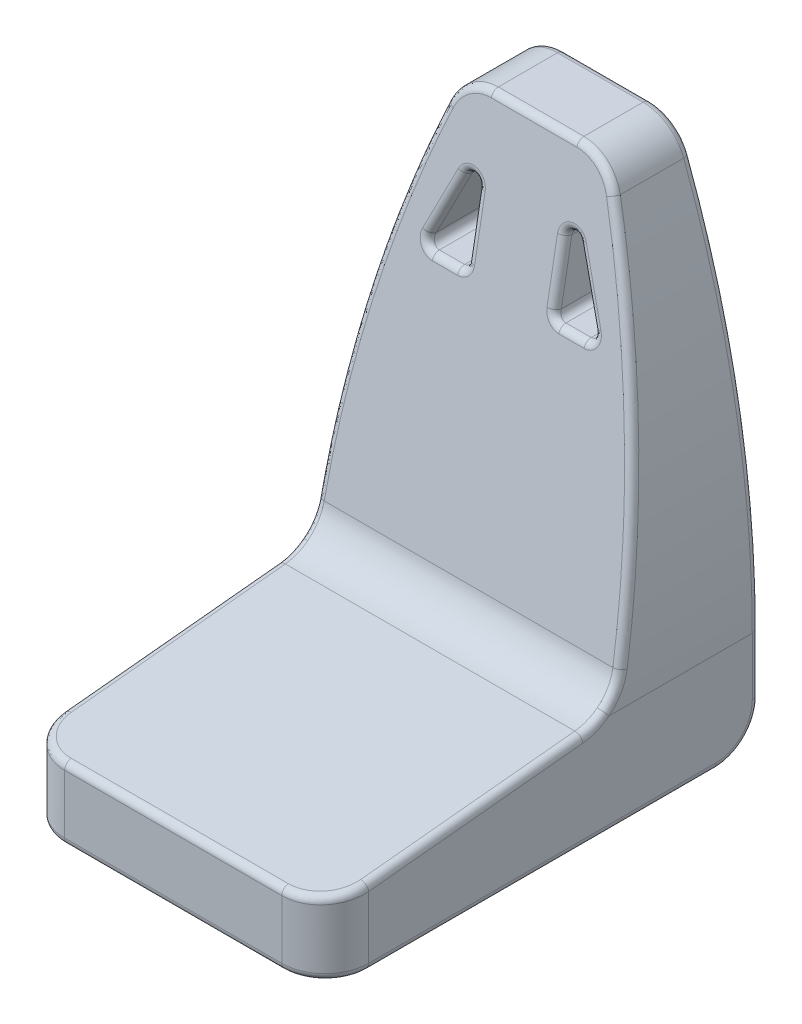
from build123d import *

# Parameters (mm, degrees)
SKETCH_2_W          = 21
SKETCH_2_H          = 30
EXTRUDE_1_DEPTH     = 35
CUT_EXTRUDE_4_DEPTH = 44.48562981
SKETCH_4_OUTSIDE_W  = 33.132
SKETCH_4_OUTSIDE_H  = 47.132
CUT_EXTRUDE_5_DEPTH = 48.2784306
CUT_EXTRUDE_6_DEPTH = 48.2784306
FILLET_1_R          = 3
FILLET_2_R          = 0.5
SKETCH_6_W          = 5
SKETCH_6_H          = 5
CUT_EXTRUDE_7_DEPTH = 2


with BuildPart() as part:
    # Sketch 2 → Extrude 1 (new body)
    with BuildSketch(Plane(origin=(0, 0, 0), x_dir=(1, 0, 0), z_dir=(0, 1, 0))):
        Rectangle(SKETCH_2_W, SKETCH_2_H)
    extrude(amount=EXTRUDE_1_DEPTH)

    # Sketch 3 → Cut-Extrude 4 (cut, through all)
    with BuildSketch(Plane(origin=(10.5, 0, 0), x_dir=(0, 0, -1), z_dir=(1, 0, 0))):
        Polygon((10, 35), (5, 7), (-15, 5), (-15, 35), align=None)
    extrude(amount=-CUT_EXTRUDE_4_DEPTH, mode=Mode.SUBTRACT)

    # Sketch 4 outside → Cut-Extrude 5 (cut, through all)
    with BuildSketch(Plane.XY.offset(15)):
        with Locations((0, 17.5)):
            Rectangle(SKETCH_4_OUTSIDE_W, SKETCH_4_OUTSIDE_H)
        with BuildLine():
            Line((-10.5, 0), (-10.5, 7))
            ThreePointArc((-10.5, 7), (-9.111986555, 21.267533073), (-5, 35))
            Line((-5, 35), (5, 35))
            ThreePointArc((5, 35), (9.111986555, 21.267533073), (10.5, 7))
            Line((10.5, 7), (10.5, 0))
            Line((10.5, 0), (-10.5, 0))
        make_face(mode=Mode.SUBTRACT)
    extrude(amount=-CUT_EXTRUDE_5_DEPTH, mode=Mode.SUBTRACT)

    # Sketch 5 → Cut-Extrude 6 (cut, through all)
    with BuildSketch(Plane.XY.offset(15)):
        Polygon((-3, 32), (-6, 25), (-3, 25), align=None)
    cut_extrude_6 = extrude(amount=-CUT_EXTRUDE_6_DEPTH, mode=Mode.SUBTRACT)

    # Mirror 1: Cut-Extrude 6 across plane
    add(cut_extrude_6.mirror(Plane(origin=(0, 0, 0), x_dir=(0, 0, 1), z_dir=(1, 0, 0))), mode=Mode.SUBTRACT)

    # Fillet 1
    fillet_1_edges = [part.edges().sort_by_distance(p)[0] for p in [
        (-5, 35, -12.5),
        (5, 35, -12.5),
        (0, 7, -5),
        (10.5, 2.5, 15),
        (-10.5, 2.5, 15),
        (0, 0, -15),
    ]]
    fillet(fillet_1_edges, radius=FILLET_1_R)

    # Fillet 2
    fillet_2_edges = [part.edges().sort_by_distance(p)[0] for p in [
        (10.5, 6.037191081, 4.628089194),
        (10.5, 0.878679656, -14.121320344),
        (0, 35, -10),
        (-9.099190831, 21.332521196, -7.559378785),
        (9.099190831, 21.332521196, -7.559378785),
        (4.668067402, 34.462487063, -9.904015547),
        (-4.668067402, 34.462487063, -9.904015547),
        (0, 5, 15),
        (-9.623957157, 5.088131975, 14.118680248),
        (9.623957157, 5.088131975, 14.118680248),
        (10.494631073, 7.891524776, -4.792796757),
        (10.5, 6.853803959, -3.191612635),
        (-10.5, 6.853803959, -3.191612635),
        (-10.494631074, 7.891524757, -4.792796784),
        (-10.5, 5, -15),
        (10.5, 5, -15),
        (9.306006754, 20.241588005, -15),
        (-4.5, 28.5, -8.839285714),
        (-4.5, 25, -8.214285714),
        (-3, 28.5, -8.839285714),
        (-3, 32, -12.232142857),
        (-3, 28.5, -15),
        (-3, 25, -11.607142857),
        (-4.5, 25, -15),
        (-6, 25, -11.607142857),
        (-4.5, 28.5, -15),
        (4.5, 25, -8.214285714),
        (4.5, 28.5, -8.839285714),
        (3, 28.5, -8.839285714),
        (3, 25, -11.607142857),
        (3, 32, -12.232142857),
        (6, 25, -11.607142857),
        (3, 28.5, -15),
        (4.5, 28.5, -15),
        (4.5, 25, -15),
        (-9.306006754, 20.241588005, -15),
        (0, 35, -15),
        (4.662175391, 34.466576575, -15),
        (-4.662175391, 34.466576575, -15),
        (-10.5, 0, 0),
        (-10.5, 6.037191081, 4.628089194),
        (-10.5, 0.878679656, -14.121320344),
        (10.5, 0, 0),
        (0, 0, 15),
        (-9.621320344, 0, 14.121320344),
        (9.621320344, 0, 14.121320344),
    ]]
    fillet(fillet_2_edges, radius=FILLET_2_R)

    # Sketch 6 → Cut-Extrude 7 (cut)
    with BuildSketch(Plane.XZ):
        with Locations((0, 5.5)):
            Rectangle(SKETCH_6_W, SKETCH_6_H)
    extrude(amount=-CUT_EXTRUDE_7_DEPTH, mode=Mode.SUBTRACT)


solid = part.part
